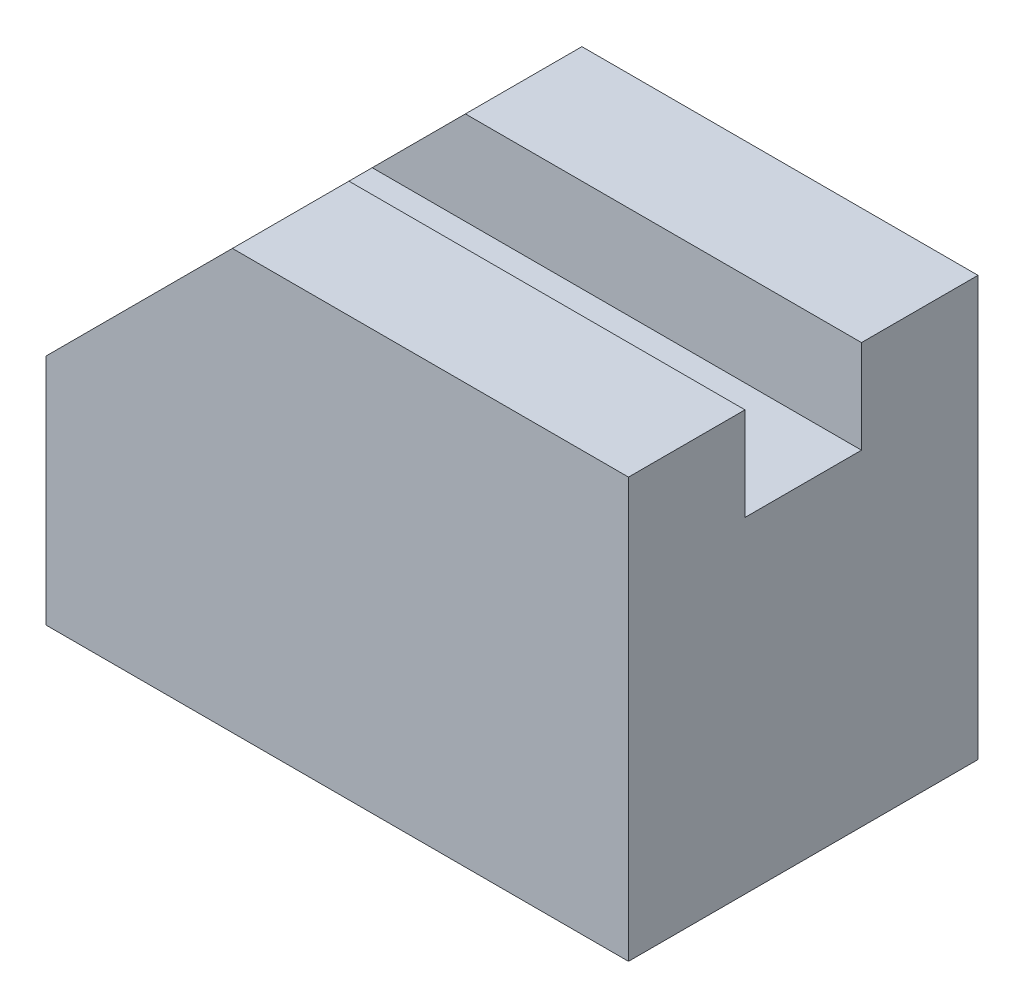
from build123d import *

# Parameters (mm, degrees)
EXTRUDE_1_DEPTH     = 30
CUT_EXTRUDE_3_DEPTH = 10
CUT_EXTRUDE_4_DEPTH = 10


with BuildPart() as part:
    # Sketch 1 → Extrude 1 (new, symmetric)
    with BuildSketch(Plane.XY):
        Polygon((0, 0), (100, 0), (100, 72), (32, 72), (0, 40), align=None)
    extrude(amount=EXTRUDE_1_DEPTH, both=True)

    # Sketch 3 → Cut-Extrude 3 (cut, symmetric)
    with BuildSketch(Plane.XY):
        Polygon((16, 56), (100, 56), (100, 72), (32, 72), align=None)
    extrude(amount=CUT_EXTRUDE_3_DEPTH, both=True, mode=Mode.SUBTRACT)

    # Sketch 4 → Cut-Extrude 4 (cut, symmetric)
    with BuildSketch(Plane.XY):
        Polygon((16, 56), (0, 40), (0, 0), (16, 0), align=None)
    extrude(amount=CUT_EXTRUDE_4_DEPTH, both=True, mode=Mode.SUBTRACT)


solid = part.part
